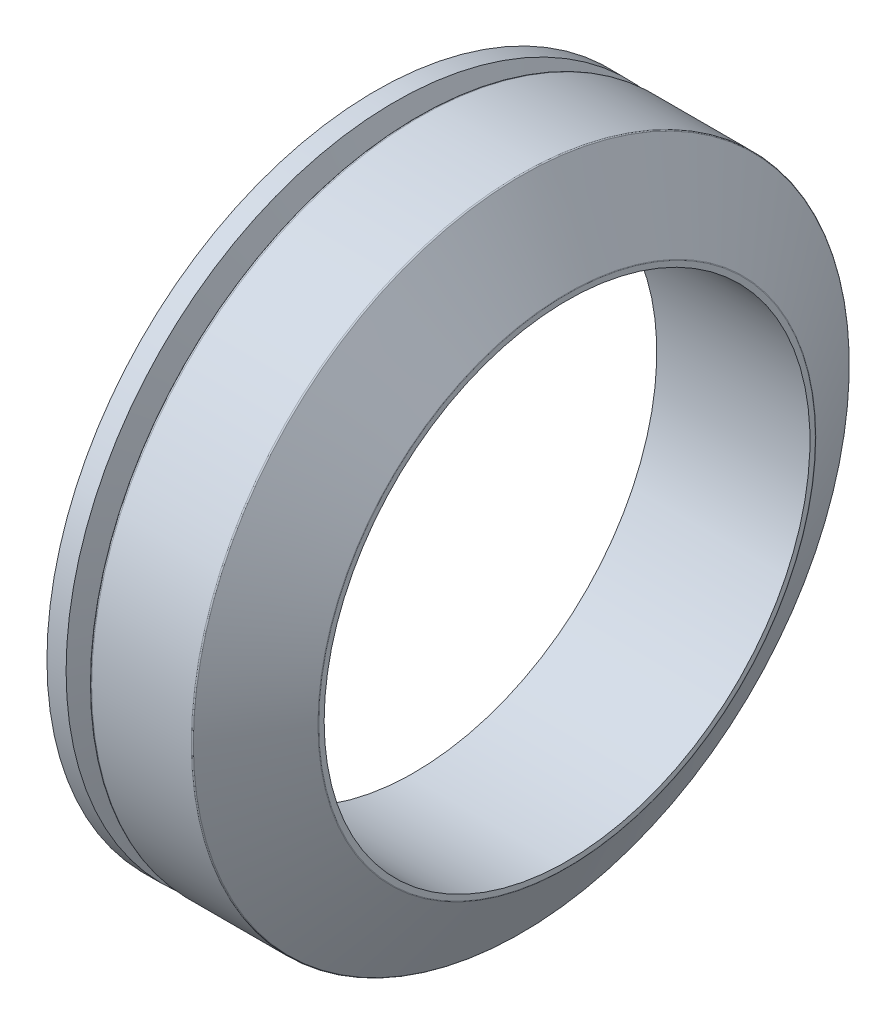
from build123d import *


with BuildPart() as part:
    # Esquisse1 → Base-R_volution (revolve)
    with BuildSketch(Plane.XY, mode=Mode.PRIVATE) as base_r_volution_sk:
        with BuildLine():
            Line((1.34, 8.5), (6.7, 8.5))
            Line((6.7, 8.5), (6.7, 8.68660254))
            ThreePointArc((6.7, 8.68660254), (6.698296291, 8.699543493), (6.69330127, 8.71160254))
            Line((6.69330127, 8.71160254), (5.097853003, 11.475))
            ThreePointArc((5.097853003, 11.475), (5.079551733, 11.49330127), (5.054551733, 11.5))
            Line((5.054551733, 11.5), (1.564355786, 11.5))
            ThreePointArc((1.564355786, 11.5), (1.500077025, 11.476604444), (1.46587501, 11.417364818))
            Line((1.46587501, 11.417364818), (1.215955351, 10))
            Line((1.215955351, 10), (0.67, 11.5))
            Line((0.67, 11.5), (0, 11.5))
            Line((0, 11.5), (1.34, 8.5))
        make_face()
    revolve(base_r_volution_sk.sketch.rotate(Axis((0, 0, 0), (1, 0, 0)), 90), axis=Axis((0, 0, 0), (1, 0, 0)))


solid = part.part
